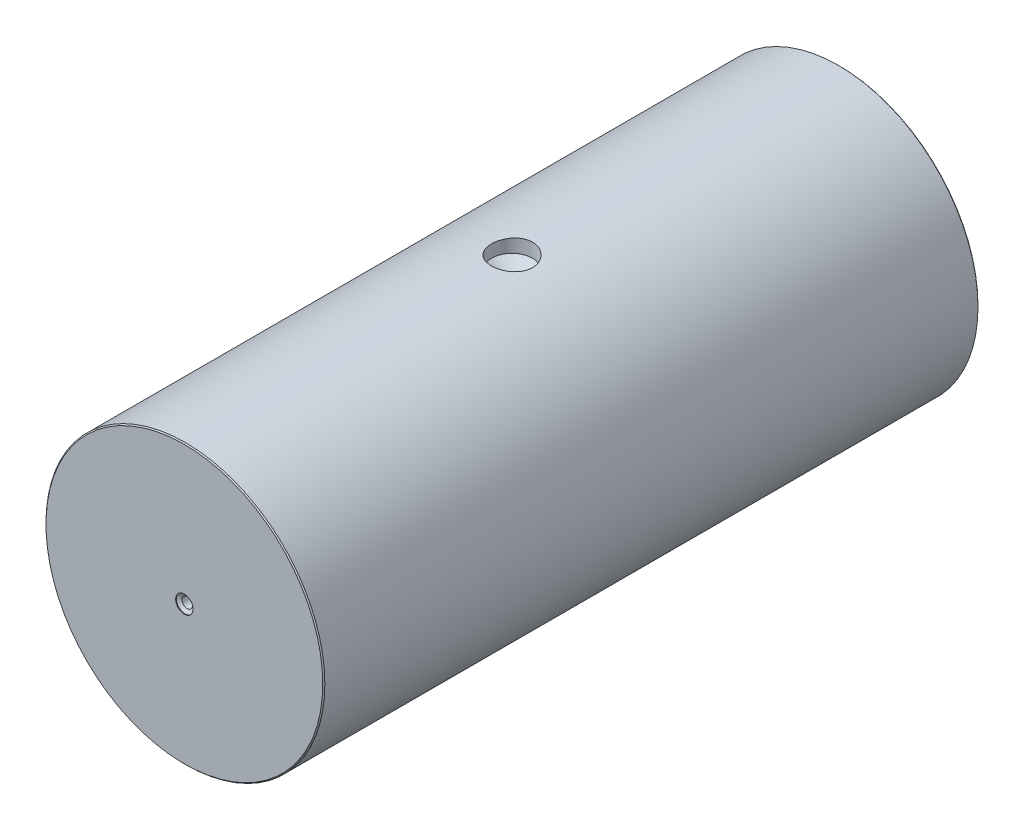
ISO-10303-21;
HEADER;
FILE_DESCRIPTION(('STEP AP214'),'2;1');
FILE_NAME('part.step','',(''),(''),'','','');
FILE_SCHEMA(('AUTOMOTIVE_DESIGN { 1 0 10303 214 1 1 1 1 }'));
ENDSEC;
DATA;
#1=APPLICATION_CONTEXT('core data for automotive mechanical design processes');
#2=APPLICATION_PROTOCOL_DEFINITION('international standard','automotive_design',2000,#1);
#3=PRODUCT_CONTEXT('',#1,'mechanical');
#4=PRODUCT('Part','Part','',(#3));
#5=PRODUCT_RELATED_PRODUCT_CATEGORY('part','',(#4));
#6=PRODUCT_DEFINITION_FORMATION('','',#4);
#7=PRODUCT_DEFINITION_CONTEXT('part definition',#1,'design');
#8=PRODUCT_DEFINITION('design','',#6,#7);
#9=PRODUCT_DEFINITION_SHAPE('','',#8);
#10=(LENGTH_UNIT() NAMED_UNIT(*) SI_UNIT(.MILLI.,.METRE.));
#11=(NAMED_UNIT(*) PLANE_ANGLE_UNIT() SI_UNIT($,.RADIAN.));
#12=(NAMED_UNIT(*) SI_UNIT($,.STERADIAN.) SOLID_ANGLE_UNIT());
#13=UNCERTAINTY_MEASURE_WITH_UNIT(LENGTH_MEASURE(1.E-05),#10,'distance_accuracy_value','');
#14=(GEOMETRIC_REPRESENTATION_CONTEXT(3) GLOBAL_UNCERTAINTY_ASSIGNED_CONTEXT((#13)) GLOBAL_UNIT_ASSIGNED_CONTEXT((#10,
#11,#12)) REPRESENTATION_CONTEXT('',''));
#15=CARTESIAN_POINT('',(0.,0.,0.));
#16=DIRECTION('',(0.,0.,1.));
#17=DIRECTION('',(1.,0.,0.));
#18=AXIS2_PLACEMENT_3D('',#15,#16,#17);
#19=CARTESIAN_POINT('',(0.,0.,-47.));
#20=DIRECTION('',(0.,0.,1.));
#21=DIRECTION('',(1.,0.,0.));
#22=AXIS2_PLACEMENT_3D('',#19,#20,#21);
#23=CYLINDRICAL_SURFACE('',#22,20.);
#24=CARTESIAN_POINT('',(0.,0.,46.85));
#25=DIRECTION('',(0.,0.,1.));
#26=DIRECTION('',(1.,0.,0.));
#27=AXIS2_PLACEMENT_3D('',#24,#25,#26);
#28=CIRCLE('',#27,20.);
#29=CARTESIAN_POINT('',(20.,0.,46.85));
#30=VERTEX_POINT('',#29);
#31=EDGE_CURVE('E356',#30,#30,#28,.F.);
#32=ORIENTED_EDGE('',*,*,#31,.T.);
#33=EDGE_LOOP('',(#32));
#34=FACE_BOUND('',#33,.T.);
#35=CARTESIAN_POINT('',(0.,0.,-46.85));
#36=DIRECTION('',(0.,0.,1.));
#37=DIRECTION('',(1.,0.,0.));
#38=AXIS2_PLACEMENT_3D('',#35,#36,#37);
#39=CIRCLE('',#38,20.);
#40=CARTESIAN_POINT('',(20.,0.,-46.85));
#41=VERTEX_POINT('',#40);
#42=EDGE_CURVE('E535',#41,#41,#39,.T.);
#43=ORIENTED_EDGE('',*,*,#42,.T.);
#44=EDGE_LOOP('',(#43));
#45=FACE_BOUND('',#44,.T.);
#46=CARTESIAN_POINT('',(0.,20.,2.95));
#47=CARTESIAN_POINT('',(-0.164743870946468,19.999997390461,2.94999318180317));
#48=CARTESIAN_POINT('',(-0.329584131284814,19.9979431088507,2.93615314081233));
#49=CARTESIAN_POINT('',(-0.654659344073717,19.9899458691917,2.88117140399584));
#50=CARTESIAN_POINT('',(-0.814889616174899,19.9839990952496,2.84000291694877));
#51=CARTESIAN_POINT('',(-1.12599314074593,19.9688853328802,2.73161930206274));
#52=CARTESIAN_POINT('',(-1.2768732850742,19.9597207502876,2.66442362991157));
#53=CARTESIAN_POINT('',(-1.56519264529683,19.9391847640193,2.50594011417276));
#54=CARTESIAN_POINT('',(-1.70263377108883,19.9278136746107,2.41465570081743));
#55=CARTESIAN_POINT('',(-1.96123689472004,19.9040335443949,2.20984999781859));
#56=CARTESIAN_POINT('',(-2.08228251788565,19.8916180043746,2.09618250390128));
#57=CARTESIAN_POINT('',(-2.3036547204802,19.8671993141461,1.85015181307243));
#58=CARTESIAN_POINT('',(-2.40398012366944,19.8551961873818,1.71778755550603));
#59=CARTESIAN_POINT('',(-2.58151504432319,19.8328982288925,1.4373413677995));
#60=CARTESIAN_POINT('',(-2.65861233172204,19.8226117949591,1.28918766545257));
#61=CARTESIAN_POINT('',(-2.786785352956,19.8050003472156,0.981857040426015));
#62=CARTESIAN_POINT('',(-2.83786245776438,19.7976751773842,0.822680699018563));
#63=CARTESIAN_POINT('',(-2.91218459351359,19.7868793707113,0.499045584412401));
#64=CARTESIAN_POINT('',(-2.9356285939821,19.7833811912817,0.334633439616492));
#65=CARTESIAN_POINT('',(-2.95463534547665,19.7805517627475,0.0041743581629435));
#66=CARTESIAN_POINT('',(-2.95019964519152,19.7812202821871,-0.161872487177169));
#67=CARTESIAN_POINT('',(-2.91373558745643,19.7866235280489,-0.489484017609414));
#68=CARTESIAN_POINT('',(-2.88192856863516,19.7913256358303,-0.651073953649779));
#69=CARTESIAN_POINT('',(-2.79197111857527,19.8042153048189,-0.966597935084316));
#70=CARTESIAN_POINT('',(-2.73381996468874,19.8124029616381,-1.12053177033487));
#71=CARTESIAN_POINT('',(-2.59259390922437,19.8313773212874,-1.41704889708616));
#72=CARTESIAN_POINT('',(-2.50942499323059,19.8421737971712,-1.55958676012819));
#73=CARTESIAN_POINT('',(-2.3205912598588,19.8651421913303,-1.82876726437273));
#74=CARTESIAN_POINT('',(-2.21492501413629,19.8773141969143,-1.95540889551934));
#75=CARTESIAN_POINT('',(-1.9828798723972,19.9018063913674,-2.19048505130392));
#76=CARTESIAN_POINT('',(-1.85631062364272,19.9141268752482,-2.2987317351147));
#77=CARTESIAN_POINT('',(-1.58670179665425,19.9374184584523,-2.49247536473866));
#78=CARTESIAN_POINT('',(-1.443662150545,19.9483895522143,-2.57797221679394));
#79=CARTESIAN_POINT('',(-1.14501201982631,19.9677571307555,-2.72379786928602));
#80=CARTESIAN_POINT('',(-0.989394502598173,19.9761521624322,-2.78411247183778));
#81=CARTESIAN_POINT('',(-0.670088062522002,19.9894094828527,-2.87769974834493));
#82=CARTESIAN_POINT('',(-0.506399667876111,19.9942720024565,-2.91097418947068));
#83=CARTESIAN_POINT('',(-0.177219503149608,19.9998859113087,-2.94928750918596));
#84=CARTESIAN_POINT('',(-0.0117584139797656,20.0006749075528,-2.95458468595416));
#85=CARTESIAN_POINT('',(0.317689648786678,19.9981551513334,-2.93747828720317));
#86=CARTESIAN_POINT('',(0.481676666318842,19.9948465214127,-2.91507554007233));
#87=CARTESIAN_POINT('',(0.802741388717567,19.9845265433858,-2.84341999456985));
#88=CARTESIAN_POINT('',(0.959847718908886,19.9775325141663,-2.79429274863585));
#89=CARTESIAN_POINT('',(1.26359350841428,19.9606235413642,-2.67071494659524));
#90=CARTESIAN_POINT('',(1.41023248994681,19.9507084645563,-2.59626323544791));
#91=CARTESIAN_POINT('',(1.69001876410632,19.9289661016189,-2.42354189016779));
#92=CARTESIAN_POINT('',(1.82306366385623,19.9171258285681,-2.32510805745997));
#93=CARTESIAN_POINT('',(2.07083767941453,19.8928921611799,-2.10744564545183));
#94=CARTESIAN_POINT('',(2.18556576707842,19.8804987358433,-1.98821589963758));
#95=CARTESIAN_POINT('',(2.39438679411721,19.856436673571,-1.73119752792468));
#96=CARTESIAN_POINT('',(2.4883067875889,19.8447746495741,-1.59326767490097));
#97=CARTESIAN_POINT('',(2.65164425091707,19.8236120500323,-1.30343792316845));
#98=CARTESIAN_POINT('',(2.72106236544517,19.814111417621,-1.15153839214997));
#99=CARTESIAN_POINT('',(2.83315620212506,19.7983948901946,-0.838601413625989));
#100=CARTESIAN_POINT('',(2.87592363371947,19.7921677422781,-0.677597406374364));
#101=CARTESIAN_POINT('',(2.9337943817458,19.7836730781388,-0.35059352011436));
#102=CARTESIAN_POINT('',(2.94889954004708,19.7814052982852,-0.18459397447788));
#103=CARTESIAN_POINT('',(2.95097422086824,19.7810957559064,0.145965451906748));
#104=CARTESIAN_POINT('',(2.93821564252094,19.7830131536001,0.31052365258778));
#105=CARTESIAN_POINT('',(2.88550694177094,19.7907692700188,0.63512705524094));
#106=CARTESIAN_POINT('',(2.84555685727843,19.7966079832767,0.795172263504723));
#107=CARTESIAN_POINT('',(2.73969416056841,19.811534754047,1.10613546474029));
#108=CARTESIAN_POINT('',(2.67379992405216,19.8206205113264,1.25705983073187));
#109=CARTESIAN_POINT('',(2.51794640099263,19.8410205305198,1.54575484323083));
#110=CARTESIAN_POINT('',(2.42798635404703,19.8523348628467,1.68352507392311));
#111=CARTESIAN_POINT('',(2.22556464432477,19.876048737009,1.94338344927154));
#112=CARTESIAN_POINT('',(2.11290144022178,19.8884573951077,2.06531378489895));
#113=CARTESIAN_POINT('',(1.86869726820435,19.9128851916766,2.28863519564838));
#114=CARTESIAN_POINT('',(1.73715191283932,19.924904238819,2.39002148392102));
#115=CARTESIAN_POINT('',(1.4580969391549,19.9472713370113,2.56985609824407));
#116=CARTESIAN_POINT('',(1.31050621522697,19.9576101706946,2.64817969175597));
#117=CARTESIAN_POINT('',(1.00418307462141,19.9753613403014,2.77880967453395));
#118=CARTESIAN_POINT('',(0.845462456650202,19.9827767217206,2.83114315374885));
#119=CARTESIAN_POINT('',(0.571681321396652,19.9921424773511,2.89636367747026));
#120=CARTESIAN_POINT('',(0.458315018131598,19.9950740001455,2.91644676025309));
#121=CARTESIAN_POINT('',(0.229981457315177,19.9990036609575,2.94326722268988));
#122=CARTESIAN_POINT('',(0.115014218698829,20.0000018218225,2.95000476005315));
#123=CARTESIAN_POINT('',(0.,20.,2.95));
#124=B_SPLINE_CURVE_WITH_KNOTS('',3,(#46,#47,#48,#49,#50,#51,#52,#53,#54,#55,#56,#57,#58,#59,
#60,#61,#62,#63,#64,#65,#66,#67,#68,#69,#70,#71,#72,#73,#74,#75,#76,#77,#78,#79,#80,#81,#82,#83,
#84,#85,#86,#87,#88,#89,#90,#91,#92,#93,#94,#95,#96,#97,#98,#99,#100,#101,#102,#103,#104,#105,
#106,#107,#108,#109,#110,#111,#112,#113,#114,#115,#116,#117,#118,#119,#120,#121,#122,#123),
.UNSPECIFIED.,.T.,.F.,(4,2,2,2,2,2,2,2,2,2,2,2,2,2,2,2,2,2,2,2,2,2,2,2,2,2,2,2,2,2,2,2,2,2,2,2,
2,2,4),(0.,0.493811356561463,0.988107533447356,1.4820349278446,1.975892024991,2.47308887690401,
2.97031394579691,3.46990426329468,3.96946825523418,4.4654127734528,4.96132974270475,
5.45327375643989,5.94523126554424,6.43906110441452,6.93292230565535,7.4315576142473,
7.93019497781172,8.42911309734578,8.92799860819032,9.42227003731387,9.91652668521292,
10.4084811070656,10.9004579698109,11.3959028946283,11.8913756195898,12.3908236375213,
12.8902585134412,13.3879651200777,13.8856385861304,14.3784773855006,14.87131549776,
15.3638051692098,15.8563104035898,16.353397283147,16.8505998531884,17.3504440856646,
17.849766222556,18.1945195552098,18.5392688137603),.UNSPECIFIED.);
#125=CARTESIAN_POINT('',(0.,20.,2.95));
#126=VERTEX_POINT('',#125);
#127=EDGE_CURVE('E398',#126,#126,#124,.T.);
#128=ORIENTED_EDGE('',*,*,#127,.T.);
#129=EDGE_LOOP('',(#128));
#130=FACE_BOUND('',#129,.T.);
#131=ADVANCED_FACE('F348',(#34,#45,#130),#23,.T.);
#132=CARTESIAN_POINT('',(0.,0.,-47.));
#133=DIRECTION('',(0.,0.,1.));
#134=DIRECTION('',(1.,0.,0.));
#135=AXIS2_PLACEMENT_3D('',#132,#133,#134);
#136=PLANE('',#135);
#137=CARTESIAN_POINT('',(0.,0.,-47.));
#138=DIRECTION('',(0.,0.,1.));
#139=DIRECTION('',(1.,0.,0.));
#140=AXIS2_PLACEMENT_3D('',#137,#138,#139);
#141=CIRCLE('',#140,19.85);
#142=CARTESIAN_POINT('',(19.85,0.,-47.));
#143=VERTEX_POINT('',#142);
#144=EDGE_CURVE('E11',#143,#143,#141,.F.);
#145=ORIENTED_EDGE('',*,*,#144,.T.);
#146=EDGE_LOOP('',(#145));
#147=FACE_BOUND('',#146,.T.);
#148=CARTESIAN_POINT('',(0.,0.,-47.));
#149=DIRECTION('',(0.,0.,-1.));
#150=DIRECTION('',(-1.,0.,0.));
#151=AXIS2_PLACEMENT_3D('',#148,#149,#150);
#152=CIRCLE('',#151,1.25);
#153=CARTESIAN_POINT('',(-1.25,0.,-47.));
#154=VERTEX_POINT('',#153);
#155=EDGE_CURVE('E432',#154,#154,#152,.T.);
#156=ORIENTED_EDGE('',*,*,#155,.F.);
#157=EDGE_LOOP('',(#156));
#158=FACE_BOUND('',#157,.T.);
#159=ADVANCED_FACE('F420',(#147,#158),#136,.F.);
#160=CARTESIAN_POINT('',(0.,0.,47.));
#161=DIRECTION('',(0.,0.,1.));
#162=DIRECTION('',(1.,0.,0.));
#163=AXIS2_PLACEMENT_3D('',#160,#161,#162);
#164=PLANE('',#163);
#165=CARTESIAN_POINT('',(0.,0.,47.));
#166=DIRECTION('',(0.,0.,1.));
#167=DIRECTION('',(1.,0.,0.));
#168=AXIS2_PLACEMENT_3D('',#165,#166,#167);
#169=CIRCLE('',#168,19.85);
#170=CARTESIAN_POINT('',(19.85,0.,47.));
#171=VERTEX_POINT('',#170);
#172=EDGE_CURVE('E404',#171,#171,#169,.T.);
#173=ORIENTED_EDGE('',*,*,#172,.T.);
#174=EDGE_LOOP('',(#173));
#175=FACE_BOUND('',#174,.T.);
#176=CARTESIAN_POINT('',(0.,0.,47.));
#177=DIRECTION('',(0.,0.,1.));
#178=DIRECTION('',(1.,0.,0.));
#179=AXIS2_PLACEMENT_3D('',#176,#177,#178);
#180=CIRCLE('',#179,1.25);
#181=CARTESIAN_POINT('',(1.25,0.,47.));
#182=VERTEX_POINT('',#181);
#183=EDGE_CURVE('E392',#182,#182,#180,.T.);
#184=ORIENTED_EDGE('',*,*,#183,.F.);
#185=EDGE_LOOP('',(#184));
#186=FACE_BOUND('',#185,.T.);
#187=ADVANCED_FACE('F417',(#175,#186),#164,.T.);
#188=CARTESIAN_POINT('',(0.,16.2968167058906,0.));
#189=DIRECTION('',(0.,1.,0.));
#190=DIRECTION('',(0.,0.,1.));
#191=AXIS2_PLACEMENT_3D('',#188,#189,#190);
#192=CONICAL_SURFACE('',#191,0.,1.04719755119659);
#193=CARTESIAN_POINT('',(0.,18.,0.));
#194=DIRECTION('',(0.,1.,0.));
#195=DIRECTION('',(0.,0.,1.));
#196=AXIS2_PLACEMENT_3D('',#193,#194,#195);
#197=CIRCLE('',#196,2.95);
#198=CARTESIAN_POINT('',(0.,18.,2.95));
#199=VERTEX_POINT('',#198);
#200=EDGE_CURVE('E395',#199,#199,#197,.T.);
#201=ORIENTED_EDGE('',*,*,#200,.T.);
#202=EDGE_LOOP('',(#201));
#203=FACE_BOUND('',#202,.T.);
#204=CARTESIAN_POINT('',(0.,16.2968167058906,0.));
#205=VERTEX_POINT('',#204);
#206=VERTEX_LOOP('',#205);
#207=FACE_BOUND('',#206,.T.);
#208=ADVANCED_FACE('F412',(#203,#207),#192,.F.);
#209=CARTESIAN_POINT('',(0.,25.9705142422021,0.));
#210=DIRECTION('',(0.,1.,0.));
#211=DIRECTION('',(0.,0.,1.));
#212=AXIS2_PLACEMENT_3D('',#209,#210,#211);
#213=CYLINDRICAL_SURFACE('',#212,2.95);
#214=ORIENTED_EDGE('',*,*,#127,.F.);
#215=EDGE_LOOP('',(#214));
#216=FACE_BOUND('',#215,.T.);
#217=ORIENTED_EDGE('',*,*,#200,.F.);
#218=EDGE_LOOP('',(#217));
#219=FACE_BOUND('',#218,.T.);
#220=ADVANCED_FACE('F406',(#216,#219),#213,.F.);
#221=CARTESIAN_POINT('',(0.,0.,47.));
#222=DIRECTION('',(0.,0.,1.));
#223=DIRECTION('',(1.,0.,0.));
#224=AXIS2_PLACEMENT_3D('',#221,#222,#223);
#225=CYLINDRICAL_SURFACE('',#224,1.25);
#226=CARTESIAN_POINT('',(0.,0.,46.9));
#227=DIRECTION('',(0.,0.,1.));
#228=DIRECTION('',(1.,0.,0.));
#229=AXIS2_PLACEMENT_3D('',#226,#227,#228);
#230=CIRCLE('',#229,1.25);
#231=CARTESIAN_POINT('',(1.25,0.,46.9));
#232=VERTEX_POINT('',#231);
#233=EDGE_CURVE('E389',#232,#232,#230,.T.);
#234=ORIENTED_EDGE('',*,*,#233,.F.);
#235=EDGE_LOOP('',(#234));
#236=FACE_BOUND('',#235,.T.);
#237=ORIENTED_EDGE('',*,*,#183,.T.);
#238=EDGE_LOOP('',(#237));
#239=FACE_BOUND('',#238,.T.);
#240=ADVANCED_FACE('F411',(#236,#239),#225,.F.);
#241=CARTESIAN_POINT('',(0.,0.,46.9));
#242=DIRECTION('',(0.,0.,1.));
#243=DIRECTION('',(1.,0.,0.));
#244=AXIS2_PLACEMENT_3D('',#241,#242,#243);
#245=CONICAL_SURFACE('',#244,1.25,1.02974425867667);
#246=CARTESIAN_POINT('',(0.,0.,46.5995696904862));
#247=DIRECTION('',(0.,0.,1.));
#248=DIRECTION('',(1.,0.,0.));
#249=AXIS2_PLACEMENT_3D('',#246,#247,#248);
#250=CIRCLE('',#249,0.75);
#251=CARTESIAN_POINT('',(0.75,0.,46.5995696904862));
#252=VERTEX_POINT('',#251);
#253=EDGE_CURVE('E380',#252,#252,#250,.T.);
#254=ORIENTED_EDGE('',*,*,#253,.F.);
#255=EDGE_LOOP('',(#254));
#256=FACE_BOUND('',#255,.T.);
#257=ORIENTED_EDGE('',*,*,#233,.T.);
#258=EDGE_LOOP('',(#257));
#259=FACE_BOUND('',#258,.T.);
#260=ADVANCED_FACE('F461',(#256,#259),#245,.F.);
#261=CARTESIAN_POINT('',(0.,0.,47.));
#262=DIRECTION('',(0.,0.,1.));
#263=DIRECTION('',(1.,0.,0.));
#264=AXIS2_PLACEMENT_3D('',#261,#262,#263);
#265=CYLINDRICAL_SURFACE('',#264,0.75);
#266=CARTESIAN_POINT('',(0.,0.,44.5));
#267=DIRECTION('',(0.,0.,1.));
#268=DIRECTION('',(1.,0.,0.));
#269=AXIS2_PLACEMENT_3D('',#266,#267,#268);
#270=CIRCLE('',#269,0.750000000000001);
#271=CARTESIAN_POINT('',(0.750000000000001,0.,44.5));
#272=VERTEX_POINT('',#271);
#273=EDGE_CURVE('E376',#272,#272,#270,.T.);
#274=ORIENTED_EDGE('',*,*,#273,.F.);
#275=EDGE_LOOP('',(#274));
#276=FACE_BOUND('',#275,.T.);
#277=ORIENTED_EDGE('',*,*,#253,.T.);
#278=EDGE_LOOP('',(#277));
#279=FACE_BOUND('',#278,.T.);
#280=ADVANCED_FACE('F459',(#276,#279),#265,.F.);
#281=CARTESIAN_POINT('',(0.,0.,44.5));
#282=DIRECTION('',(0.,0.,1.));
#283=DIRECTION('',(1.,0.,0.));
#284=AXIS2_PLACEMENT_3D('',#281,#282,#283);
#285=CONICAL_SURFACE('',#284,0.750000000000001,1.02974425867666);
#286=CARTESIAN_POINT('',(0.,0.,44.0493545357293));
#287=VERTEX_POINT('',#286);
#288=VERTEX_LOOP('',#287);
#289=FACE_BOUND('',#288,.T.);
#290=ORIENTED_EDGE('',*,*,#273,.T.);
#291=EDGE_LOOP('',(#290));
#292=FACE_BOUND('',#291,.T.);
#293=ADVANCED_FACE('F370',(#289,#292),#285,.F.);
#294=CARTESIAN_POINT('',(0.,0.,-44.5));
#295=DIRECTION('',(0.,0.,-1.));
#296=DIRECTION('',(-1.,0.,0.));
#297=AXIS2_PLACEMENT_3D('',#294,#295,#296);
#298=CONICAL_SURFACE('',#297,0.750000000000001,1.02974425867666);
#299=CARTESIAN_POINT('',(0.,0.,-44.0493545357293));
#300=VERTEX_POINT('',#299);
#301=VERTEX_LOOP('',#300);
#302=FACE_BOUND('',#301,.T.);
#303=CARTESIAN_POINT('',(0.,0.,-44.5));
#304=DIRECTION('',(0.,0.,-1.));
#305=DIRECTION('',(-1.,0.,0.));
#306=AXIS2_PLACEMENT_3D('',#303,#304,#305);
#307=CIRCLE('',#306,0.750000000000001);
#308=CARTESIAN_POINT('',(-0.750000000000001,0.,-44.5));
#309=VERTEX_POINT('',#308);
#310=EDGE_CURVE('E374',#309,#309,#307,.T.);
#311=ORIENTED_EDGE('',*,*,#310,.T.);
#312=EDGE_LOOP('',(#311));
#313=FACE_BOUND('',#312,.T.);
#314=ADVANCED_FACE('F366',(#302,#313),#298,.F.);
#315=CARTESIAN_POINT('',(0.,0.,-47.));
#316=DIRECTION('',(0.,0.,-1.));
#317=DIRECTION('',(-1.,0.,0.));
#318=AXIS2_PLACEMENT_3D('',#315,#316,#317);
#319=CYLINDRICAL_SURFACE('',#318,0.750000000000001);
#320=ORIENTED_EDGE('',*,*,#310,.F.);
#321=EDGE_LOOP('',(#320));
#322=FACE_BOUND('',#321,.T.);
#323=CARTESIAN_POINT('',(0.,0.,-46.5995696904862));
#324=DIRECTION('',(0.,0.,-1.));
#325=DIRECTION('',(-1.,0.,0.));
#326=AXIS2_PLACEMENT_3D('',#323,#324,#325);
#327=CIRCLE('',#326,0.750000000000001);
#328=CARTESIAN_POINT('',(-0.750000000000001,0.,-46.5995696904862));
#329=VERTEX_POINT('',#328);
#330=EDGE_CURVE('E377',#329,#329,#327,.T.);
#331=ORIENTED_EDGE('',*,*,#330,.T.);
#332=EDGE_LOOP('',(#331));
#333=FACE_BOUND('',#332,.T.);
#334=ADVANCED_FACE('F369',(#322,#333),#319,.F.);
#335=CARTESIAN_POINT('',(0.,0.,-46.9));
#336=DIRECTION('',(0.,0.,-1.));
#337=DIRECTION('',(-1.,0.,0.));
#338=AXIS2_PLACEMENT_3D('',#335,#336,#337);
#339=CONICAL_SURFACE('',#338,1.25,1.02974425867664);
#340=ORIENTED_EDGE('',*,*,#330,.F.);
#341=EDGE_LOOP('',(#340));
#342=FACE_BOUND('',#341,.T.);
#343=CARTESIAN_POINT('',(0.,0.,-46.9));
#344=DIRECTION('',(0.,0.,-1.));
#345=DIRECTION('',(-1.,0.,0.));
#346=AXIS2_PLACEMENT_3D('',#343,#344,#345);
#347=CIRCLE('',#346,1.25);
#348=CARTESIAN_POINT('',(-1.25,0.,-46.9));
#349=VERTEX_POINT('',#348);
#350=EDGE_CURVE('E383',#349,#349,#347,.T.);
#351=ORIENTED_EDGE('',*,*,#350,.T.);
#352=EDGE_LOOP('',(#351));
#353=FACE_BOUND('',#352,.T.);
#354=ADVANCED_FACE('F438',(#342,#353),#339,.F.);
#355=CARTESIAN_POINT('',(0.,0.,-47.));
#356=DIRECTION('',(0.,0.,-1.));
#357=DIRECTION('',(-1.,0.,0.));
#358=AXIS2_PLACEMENT_3D('',#355,#356,#357);
#359=CYLINDRICAL_SURFACE('',#358,1.25);
#360=ORIENTED_EDGE('',*,*,#350,.F.);
#361=EDGE_LOOP('',(#360));
#362=FACE_BOUND('',#361,.T.);
#363=ORIENTED_EDGE('',*,*,#155,.T.);
#364=EDGE_LOOP('',(#363));
#365=FACE_BOUND('',#364,.T.);
#366=ADVANCED_FACE('F440',(#362,#365),#359,.F.);
#367=CARTESIAN_POINT('',(0.,0.,47.));
#368=DIRECTION('',(0.,0.,-1.));
#369=DIRECTION('',(-1.,0.,0.));
#370=AXIS2_PLACEMENT_3D('',#367,#368,#369);
#371=CONICAL_SURFACE('',#370,19.85,0.785398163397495);
#372=ORIENTED_EDGE('',*,*,#31,.F.);
#373=EDGE_LOOP('',(#372));
#374=FACE_BOUND('',#373,.T.);
#375=ORIENTED_EDGE('',*,*,#172,.F.);
#376=EDGE_LOOP('',(#375));
#377=FACE_BOUND('',#376,.T.);
#378=ADVANCED_FACE('F442',(#374,#377),#371,.T.);
#379=CARTESIAN_POINT('',(0.,0.,-46.85));
#380=DIRECTION('',(0.,0.,1.));
#381=DIRECTION('',(1.,0.,0.));
#382=AXIS2_PLACEMENT_3D('',#379,#380,#381);
#383=CONICAL_SURFACE('',#382,20.,0.785398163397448);
#384=ORIENTED_EDGE('',*,*,#144,.F.);
#385=EDGE_LOOP('',(#384));
#386=FACE_BOUND('',#385,.T.);
#387=ORIENTED_EDGE('',*,*,#42,.F.);
#388=EDGE_LOOP('',(#387));
#389=FACE_BOUND('',#388,.T.);
#390=ADVANCED_FACE('F448',(#386,#389),#383,.T.);
#391=CLOSED_SHELL('',(#131,#159,#187,#208,#220,#240,#260,#280,#293,#314,#334,#354,#366,#378,#390));
#392=MANIFOLD_SOLID_BREP('B2',#391);
#393=ADVANCED_BREP_SHAPE_REPRESENTATION('',(#18,#392),#14);
#394=SHAPE_DEFINITION_REPRESENTATION(#9,#393);
ENDSEC;
END-ISO-10303-21;
